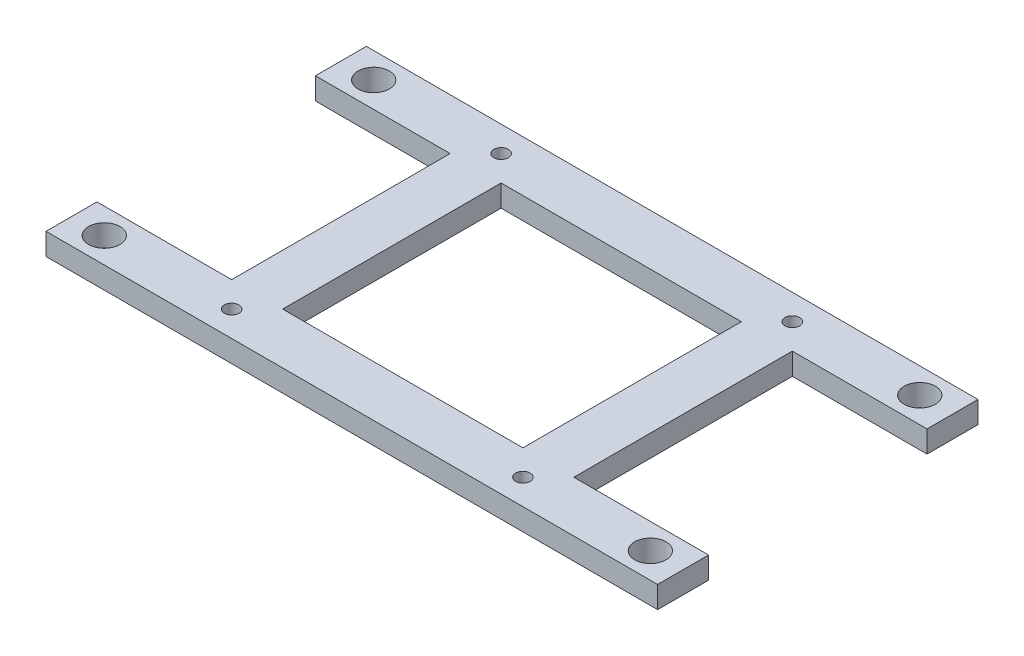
ISO-10303-21;
HEADER;
FILE_DESCRIPTION(('STEP AP214'),'2;1');
FILE_NAME('part.step','',(''),(''),'','','');
FILE_SCHEMA(('AUTOMOTIVE_DESIGN { 1 0 10303 214 1 1 1 1 }'));
ENDSEC;
DATA;
#1=APPLICATION_CONTEXT('core data for automotive mechanical design processes');
#2=APPLICATION_PROTOCOL_DEFINITION('international standard','automotive_design',2000,#1);
#3=PRODUCT_CONTEXT('',#1,'mechanical');
#4=PRODUCT('Part','Part','',(#3));
#5=PRODUCT_RELATED_PRODUCT_CATEGORY('part','',(#4));
#6=PRODUCT_DEFINITION_FORMATION('','',#4);
#7=PRODUCT_DEFINITION_CONTEXT('part definition',#1,'design');
#8=PRODUCT_DEFINITION('design','',#6,#7);
#9=PRODUCT_DEFINITION_SHAPE('','',#8);
#10=(LENGTH_UNIT() NAMED_UNIT(*) SI_UNIT(.MILLI.,.METRE.));
#11=(NAMED_UNIT(*) PLANE_ANGLE_UNIT() SI_UNIT($,.RADIAN.));
#12=(NAMED_UNIT(*) SI_UNIT($,.STERADIAN.) SOLID_ANGLE_UNIT());
#13=UNCERTAINTY_MEASURE_WITH_UNIT(LENGTH_MEASURE(1.E-05),#10,'distance_accuracy_value','');
#14=(GEOMETRIC_REPRESENTATION_CONTEXT(3) GLOBAL_UNCERTAINTY_ASSIGNED_CONTEXT((#13)) GLOBAL_UNIT_ASSIGNED_CONTEXT((#10,
#11,#12)) REPRESENTATION_CONTEXT('',''));
#15=CARTESIAN_POINT('',(0.,0.,0.));
#16=DIRECTION('',(0.,0.,1.));
#17=DIRECTION('',(1.,0.,0.));
#18=AXIS2_PLACEMENT_3D('',#15,#16,#17);
#19=CARTESIAN_POINT('',(0.,1.5,0.));
#20=DIRECTION('',(0.,1.,0.));
#21=DIRECTION('',(0.,0.,1.));
#22=AXIS2_PLACEMENT_3D('',#19,#20,#21);
#23=PLANE('',#22);
#24=CARTESIAN_POINT('',(37.5,1.5,18.5));
#25=DIRECTION('',(0.,1.,0.));
#26=DIRECTION('',(0.,0.,1.));
#27=AXIS2_PLACEMENT_3D('',#24,#25,#26);
#28=CIRCLE('',#27,2.15);
#29=CARTESIAN_POINT('',(37.5,1.5,20.65));
#30=VERTEX_POINT('',#29);
#31=EDGE_CURVE('E650',#30,#30,#28,.T.);
#32=ORIENTED_EDGE('',*,*,#31,.F.);
#33=EDGE_LOOP('',(#32));
#34=FACE_BOUND('',#33,.T.);
#35=CARTESIAN_POINT('',(-37.5,1.5,-18.5));
#36=DIRECTION('',(0.,1.,0.));
#37=DIRECTION('',(0.,0.,1.));
#38=AXIS2_PLACEMENT_3D('',#35,#36,#37);
#39=CIRCLE('',#38,2.15);
#40=CARTESIAN_POINT('',(-37.5,1.5,-16.35));
#41=VERTEX_POINT('',#40);
#42=EDGE_CURVE('E182',#41,#41,#39,.T.);
#43=ORIENTED_EDGE('',*,*,#42,.F.);
#44=EDGE_LOOP('',(#43));
#45=FACE_BOUND('',#44,.T.);
#46=CARTESIAN_POINT('',(20.,1.5,18.5));
#47=DIRECTION('',(0.,1.,0.));
#48=DIRECTION('',(0.,0.,1.));
#49=AXIS2_PLACEMENT_3D('',#46,#47,#48);
#50=CIRCLE('',#49,1.);
#51=CARTESIAN_POINT('',(20.,1.5,19.5));
#52=VERTEX_POINT('',#51);
#53=EDGE_CURVE('E198',#52,#52,#50,.T.);
#54=ORIENTED_EDGE('',*,*,#53,.F.);
#55=EDGE_LOOP('',(#54));
#56=FACE_BOUND('',#55,.T.);
#57=CARTESIAN_POINT('',(-20.,1.5,-18.5));
#58=DIRECTION('',(0.,1.,0.));
#59=DIRECTION('',(0.,0.,1.));
#60=AXIS2_PLACEMENT_3D('',#57,#58,#59);
#61=CIRCLE('',#60,1.);
#62=CARTESIAN_POINT('',(-20.,1.5,-17.5));
#63=VERTEX_POINT('',#62);
#64=EDGE_CURVE('E210',#63,#63,#61,.T.);
#65=ORIENTED_EDGE('',*,*,#64,.F.);
#66=EDGE_LOOP('',(#65));
#67=FACE_BOUND('',#66,.T.);
#68=DIRECTION('',(1.,0.,0.));
#69=VECTOR('',#68,1.);
#70=CARTESIAN_POINT('',(42.,1.5,-15.));
#71=LINE('',#70,#69);
#72=CARTESIAN_POINT('',(23.5,1.5,-15.));
#73=VERTEX_POINT('',#72);
#74=CARTESIAN_POINT('',(42.,1.5,-15.));
#75=VERTEX_POINT('',#74);
#76=EDGE_CURVE('E216',#73,#75,#71,.T.);
#77=ORIENTED_EDGE('',*,*,#76,.T.);
#78=DIRECTION('',(0.,0.,-1.));
#79=VECTOR('',#78,1.);
#80=CARTESIAN_POINT('',(42.,1.5,-22.));
#81=LINE('',#80,#79);
#82=CARTESIAN_POINT('',(42.,1.5,-22.));
#83=VERTEX_POINT('',#82);
#84=EDGE_CURVE('E219',#75,#83,#81,.T.);
#85=ORIENTED_EDGE('',*,*,#84,.T.);
#86=DIRECTION('',(-1.,0.,0.));
#87=VECTOR('',#86,1.);
#88=CARTESIAN_POINT('',(-42.,1.5,-22.));
#89=LINE('',#88,#87);
#90=CARTESIAN_POINT('',(-42.,1.5,-22.));
#91=VERTEX_POINT('',#90);
#92=EDGE_CURVE('E222',#83,#91,#89,.T.);
#93=ORIENTED_EDGE('',*,*,#92,.T.);
#94=DIRECTION('',(0.,0.,1.));
#95=VECTOR('',#94,1.);
#96=CARTESIAN_POINT('',(-42.,1.5,-15.));
#97=LINE('',#96,#95);
#98=CARTESIAN_POINT('',(-42.,1.5,-15.));
#99=VERTEX_POINT('',#98);
#100=EDGE_CURVE('E224',#91,#99,#97,.T.);
#101=ORIENTED_EDGE('',*,*,#100,.T.);
#102=DIRECTION('',(1.,0.,0.));
#103=VECTOR('',#102,1.);
#104=CARTESIAN_POINT('',(-23.5,1.5,-15.));
#105=LINE('',#104,#103);
#106=CARTESIAN_POINT('',(-23.5,1.5,-15.));
#107=VERTEX_POINT('',#106);
#108=EDGE_CURVE('E226',#99,#107,#105,.T.);
#109=ORIENTED_EDGE('',*,*,#108,.T.);
#110=DIRECTION('',(0.,0.,1.));
#111=VECTOR('',#110,1.);
#112=CARTESIAN_POINT('',(-23.5,1.5,15.));
#113=LINE('',#112,#111);
#114=CARTESIAN_POINT('',(-23.5,1.5,15.));
#115=VERTEX_POINT('',#114);
#116=EDGE_CURVE('E228',#107,#115,#113,.T.);
#117=ORIENTED_EDGE('',*,*,#116,.T.);
#118=DIRECTION('',(-1.,0.,0.));
#119=VECTOR('',#118,1.);
#120=CARTESIAN_POINT('',(-42.,1.5,15.));
#121=LINE('',#120,#119);
#122=CARTESIAN_POINT('',(-42.,1.5,15.));
#123=VERTEX_POINT('',#122);
#124=EDGE_CURVE('E230',#115,#123,#121,.T.);
#125=ORIENTED_EDGE('',*,*,#124,.T.);
#126=DIRECTION('',(0.,0.,1.));
#127=VECTOR('',#126,1.);
#128=CARTESIAN_POINT('',(-42.,1.5,22.));
#129=LINE('',#128,#127);
#130=CARTESIAN_POINT('',(-42.,1.5,22.));
#131=VERTEX_POINT('',#130);
#132=EDGE_CURVE('E232',#123,#131,#129,.T.);
#133=ORIENTED_EDGE('',*,*,#132,.T.);
#134=DIRECTION('',(1.,0.,0.));
#135=VECTOR('',#134,1.);
#136=CARTESIAN_POINT('',(42.,1.5,22.));
#137=LINE('',#136,#135);
#138=CARTESIAN_POINT('',(42.,1.5,22.));
#139=VERTEX_POINT('',#138);
#140=EDGE_CURVE('E234',#131,#139,#137,.T.);
#141=ORIENTED_EDGE('',*,*,#140,.T.);
#142=DIRECTION('',(0.,0.,-1.));
#143=VECTOR('',#142,1.);
#144=CARTESIAN_POINT('',(42.,1.5,15.));
#145=LINE('',#144,#143);
#146=CARTESIAN_POINT('',(42.,1.5,15.));
#147=VERTEX_POINT('',#146);
#148=EDGE_CURVE('E236',#139,#147,#145,.T.);
#149=ORIENTED_EDGE('',*,*,#148,.T.);
#150=DIRECTION('',(-1.,0.,0.));
#151=VECTOR('',#150,1.);
#152=CARTESIAN_POINT('',(23.5,1.5,15.));
#153=LINE('',#152,#151);
#154=CARTESIAN_POINT('',(23.5,1.5,15.));
#155=VERTEX_POINT('',#154);
#156=EDGE_CURVE('E238',#147,#155,#153,.T.);
#157=ORIENTED_EDGE('',*,*,#156,.T.);
#158=DIRECTION('',(0.,0.,-1.));
#159=VECTOR('',#158,1.);
#160=CARTESIAN_POINT('',(23.5,1.5,-15.));
#161=LINE('',#160,#159);
#162=EDGE_CURVE('E240',#155,#73,#161,.T.);
#163=ORIENTED_EDGE('',*,*,#162,.T.);
#164=EDGE_LOOP('',(#77,#85,#93,#101,#109,#117,#125,#133,#141,#149,#157,#163));
#165=FACE_BOUND('',#164,.T.);
#166=CARTESIAN_POINT('',(20.,1.5,-18.5));
#167=DIRECTION('',(0.,1.,0.));
#168=DIRECTION('',(0.,0.,1.));
#169=AXIS2_PLACEMENT_3D('',#166,#167,#168);
#170=CIRCLE('',#169,1.);
#171=CARTESIAN_POINT('',(20.,1.5,-17.5));
#172=VERTEX_POINT('',#171);
#173=EDGE_CURVE('E204',#172,#172,#170,.T.);
#174=ORIENTED_EDGE('',*,*,#173,.F.);
#175=EDGE_LOOP('',(#174));
#176=FACE_BOUND('',#175,.T.);
#177=CARTESIAN_POINT('',(-20.,1.5,18.5));
#178=DIRECTION('',(0.,1.,0.));
#179=DIRECTION('',(0.,0.,1.));
#180=AXIS2_PLACEMENT_3D('',#177,#178,#179);
#181=CIRCLE('',#180,1.);
#182=CARTESIAN_POINT('',(-20.,1.5,19.5));
#183=VERTEX_POINT('',#182);
#184=EDGE_CURVE('E192',#183,#183,#181,.T.);
#185=ORIENTED_EDGE('',*,*,#184,.F.);
#186=EDGE_LOOP('',(#185));
#187=FACE_BOUND('',#186,.T.);
#188=DIRECTION('',(1.,0.,0.));
#189=VECTOR('',#188,1.);
#190=CARTESIAN_POINT('',(16.5,1.5,15.));
#191=LINE('',#190,#189);
#192=CARTESIAN_POINT('',(-16.5,1.5,15.));
#193=VERTEX_POINT('',#192);
#194=CARTESIAN_POINT('',(16.5,1.5,15.));
#195=VERTEX_POINT('',#194);
#196=EDGE_CURVE('E161',#193,#195,#191,.T.);
#197=ORIENTED_EDGE('',*,*,#196,.F.);
#198=DIRECTION('',(0.,0.,1.));
#199=VECTOR('',#198,1.);
#200=CARTESIAN_POINT('',(-16.5,1.5,15.));
#201=LINE('',#200,#199);
#202=CARTESIAN_POINT('',(-16.5,1.5,-15.));
#203=VERTEX_POINT('',#202);
#204=EDGE_CURVE('E153',#203,#193,#201,.T.);
#205=ORIENTED_EDGE('',*,*,#204,.F.);
#206=DIRECTION('',(-1.,0.,0.));
#207=VECTOR('',#206,1.);
#208=CARTESIAN_POINT('',(16.5,1.5,-15.));
#209=LINE('',#208,#207);
#210=CARTESIAN_POINT('',(16.5,1.5,-15.));
#211=VERTEX_POINT('',#210);
#212=EDGE_CURVE('E176',#211,#203,#209,.T.);
#213=ORIENTED_EDGE('',*,*,#212,.F.);
#214=DIRECTION('',(0.,0.,-1.));
#215=VECTOR('',#214,1.);
#216=CARTESIAN_POINT('',(16.5,1.5,15.));
#217=LINE('',#216,#215);
#218=EDGE_CURVE('E174',#195,#211,#217,.T.);
#219=ORIENTED_EDGE('',*,*,#218,.F.);
#220=EDGE_LOOP('',(#197,#205,#213,#219));
#221=FACE_BOUND('',#220,.T.);
#222=CARTESIAN_POINT('',(-37.5,1.5,18.5));
#223=DIRECTION('',(0.,1.,0.));
#224=DIRECTION('',(0.,0.,1.));
#225=AXIS2_PLACEMENT_3D('',#222,#223,#224);
#226=CIRCLE('',#225,2.15);
#227=CARTESIAN_POINT('',(-37.5,1.5,20.65));
#228=VERTEX_POINT('',#227);
#229=EDGE_CURVE('E656',#228,#228,#226,.T.);
#230=ORIENTED_EDGE('',*,*,#229,.F.);
#231=EDGE_LOOP('',(#230));
#232=FACE_BOUND('',#231,.T.);
#233=CARTESIAN_POINT('',(37.5,1.5,-18.5));
#234=DIRECTION('',(0.,1.,0.));
#235=DIRECTION('',(0.,0.,1.));
#236=AXIS2_PLACEMENT_3D('',#233,#234,#235);
#237=CIRCLE('',#236,2.15);
#238=CARTESIAN_POINT('',(37.5,1.5,-16.35));
#239=VERTEX_POINT('',#238);
#240=EDGE_CURVE('E641',#239,#239,#237,.T.);
#241=ORIENTED_EDGE('',*,*,#240,.F.);
#242=EDGE_LOOP('',(#241));
#243=FACE_BOUND('',#242,.T.);
#244=ADVANCED_FACE('F40',(#34,#45,#56,#67,#165,#176,#187,#221,#232,#243),#23,.T.);
#245=CARTESIAN_POINT('',(0.,-1.5,0.));
#246=DIRECTION('',(0.,1.,0.));
#247=DIRECTION('',(0.,0.,1.));
#248=AXIS2_PLACEMENT_3D('',#245,#246,#247);
#249=PLANE('',#248);
#250=CARTESIAN_POINT('',(-20.,-1.5,18.5));
#251=DIRECTION('',(0.,1.,0.));
#252=DIRECTION('',(0.,0.,1.));
#253=AXIS2_PLACEMENT_3D('',#250,#251,#252);
#254=CIRCLE('',#253,1.);
#255=CARTESIAN_POINT('',(-20.,-1.5,19.5));
#256=VERTEX_POINT('',#255);
#257=EDGE_CURVE('E169',#256,#256,#254,.T.);
#258=ORIENTED_EDGE('',*,*,#257,.T.);
#259=EDGE_LOOP('',(#258));
#260=FACE_BOUND('',#259,.T.);
#261=CARTESIAN_POINT('',(20.,-1.5,18.5));
#262=DIRECTION('',(0.,1.,0.));
#263=DIRECTION('',(0.,0.,1.));
#264=AXIS2_PLACEMENT_3D('',#261,#262,#263);
#265=CIRCLE('',#264,1.);
#266=CARTESIAN_POINT('',(20.,-1.5,19.5));
#267=VERTEX_POINT('',#266);
#268=EDGE_CURVE('E195',#267,#267,#265,.T.);
#269=ORIENTED_EDGE('',*,*,#268,.T.);
#270=EDGE_LOOP('',(#269));
#271=FACE_BOUND('',#270,.T.);
#272=CARTESIAN_POINT('',(20.,-1.5,-18.5));
#273=DIRECTION('',(0.,1.,0.));
#274=DIRECTION('',(0.,0.,1.));
#275=AXIS2_PLACEMENT_3D('',#272,#273,#274);
#276=CIRCLE('',#275,1.);
#277=CARTESIAN_POINT('',(20.,-1.5,-17.5));
#278=VERTEX_POINT('',#277);
#279=EDGE_CURVE('E201',#278,#278,#276,.T.);
#280=ORIENTED_EDGE('',*,*,#279,.T.);
#281=EDGE_LOOP('',(#280));
#282=FACE_BOUND('',#281,.T.);
#283=CARTESIAN_POINT('',(-20.,-1.5,-18.5));
#284=DIRECTION('',(0.,1.,0.));
#285=DIRECTION('',(0.,0.,1.));
#286=AXIS2_PLACEMENT_3D('',#283,#284,#285);
#287=CIRCLE('',#286,1.);
#288=CARTESIAN_POINT('',(-20.,-1.5,-17.5));
#289=VERTEX_POINT('',#288);
#290=EDGE_CURVE('E207',#289,#289,#287,.T.);
#291=ORIENTED_EDGE('',*,*,#290,.T.);
#292=EDGE_LOOP('',(#291));
#293=FACE_BOUND('',#292,.T.);
#294=DIRECTION('',(1.,0.,0.));
#295=VECTOR('',#294,1.);
#296=CARTESIAN_POINT('',(42.,-1.5,-15.));
#297=LINE('',#296,#295);
#298=CARTESIAN_POINT('',(23.5,-1.5,-15.));
#299=VERTEX_POINT('',#298);
#300=CARTESIAN_POINT('',(42.,-1.5,-15.));
#301=VERTEX_POINT('',#300);
#302=EDGE_CURVE('E213',#299,#301,#297,.T.);
#303=ORIENTED_EDGE('',*,*,#302,.F.);
#304=DIRECTION('',(0.,0.,-1.));
#305=VECTOR('',#304,1.);
#306=CARTESIAN_POINT('',(23.5,-1.5,-15.));
#307=LINE('',#306,#305);
#308=CARTESIAN_POINT('',(23.5,-1.5,15.));
#309=VERTEX_POINT('',#308);
#310=EDGE_CURVE('E220',#309,#299,#307,.T.);
#311=ORIENTED_EDGE('',*,*,#310,.F.);
#312=DIRECTION('',(-1.,0.,0.));
#313=VECTOR('',#312,1.);
#314=CARTESIAN_POINT('',(23.5,-1.5,15.));
#315=LINE('',#314,#313);
#316=CARTESIAN_POINT('',(42.,-1.5,15.));
#317=VERTEX_POINT('',#316);
#318=EDGE_CURVE('E263',#317,#309,#315,.T.);
#319=ORIENTED_EDGE('',*,*,#318,.F.);
#320=DIRECTION('',(0.,0.,-1.));
#321=VECTOR('',#320,1.);
#322=CARTESIAN_POINT('',(42.,-1.5,15.));
#323=LINE('',#322,#321);
#324=CARTESIAN_POINT('',(42.,-1.5,22.));
#325=VERTEX_POINT('',#324);
#326=EDGE_CURVE('E261',#325,#317,#323,.T.);
#327=ORIENTED_EDGE('',*,*,#326,.F.);
#328=DIRECTION('',(1.,0.,0.));
#329=VECTOR('',#328,1.);
#330=CARTESIAN_POINT('',(42.,-1.5,22.));
#331=LINE('',#330,#329);
#332=CARTESIAN_POINT('',(-42.,-1.5,22.));
#333=VERTEX_POINT('',#332);
#334=EDGE_CURVE('E259',#333,#325,#331,.T.);
#335=ORIENTED_EDGE('',*,*,#334,.F.);
#336=DIRECTION('',(0.,0.,1.));
#337=VECTOR('',#336,1.);
#338=CARTESIAN_POINT('',(-42.,-1.5,22.));
#339=LINE('',#338,#337);
#340=CARTESIAN_POINT('',(-42.,-1.5,15.));
#341=VERTEX_POINT('',#340);
#342=EDGE_CURVE('E257',#341,#333,#339,.T.);
#343=ORIENTED_EDGE('',*,*,#342,.F.);
#344=DIRECTION('',(-1.,0.,0.));
#345=VECTOR('',#344,1.);
#346=CARTESIAN_POINT('',(-42.,-1.5,15.));
#347=LINE('',#346,#345);
#348=CARTESIAN_POINT('',(-23.5,-1.5,15.));
#349=VERTEX_POINT('',#348);
#350=EDGE_CURVE('E255',#349,#341,#347,.T.);
#351=ORIENTED_EDGE('',*,*,#350,.F.);
#352=DIRECTION('',(0.,0.,1.));
#353=VECTOR('',#352,1.);
#354=CARTESIAN_POINT('',(-23.5,-1.5,15.));
#355=LINE('',#354,#353);
#356=CARTESIAN_POINT('',(-23.5,-1.5,-15.));
#357=VERTEX_POINT('',#356);
#358=EDGE_CURVE('E253',#357,#349,#355,.T.);
#359=ORIENTED_EDGE('',*,*,#358,.F.);
#360=DIRECTION('',(1.,0.,0.));
#361=VECTOR('',#360,1.);
#362=CARTESIAN_POINT('',(-23.5,-1.5,-15.));
#363=LINE('',#362,#361);
#364=CARTESIAN_POINT('',(-42.,-1.5,-15.));
#365=VERTEX_POINT('',#364);
#366=EDGE_CURVE('E251',#365,#357,#363,.T.);
#367=ORIENTED_EDGE('',*,*,#366,.F.);
#368=DIRECTION('',(0.,0.,1.));
#369=VECTOR('',#368,1.);
#370=CARTESIAN_POINT('',(-42.,-1.5,-15.));
#371=LINE('',#370,#369);
#372=CARTESIAN_POINT('',(-42.,-1.5,-22.));
#373=VERTEX_POINT('',#372);
#374=EDGE_CURVE('E249',#373,#365,#371,.T.);
#375=ORIENTED_EDGE('',*,*,#374,.F.);
#376=DIRECTION('',(-1.,0.,0.));
#377=VECTOR('',#376,1.);
#378=CARTESIAN_POINT('',(-42.,-1.5,-22.));
#379=LINE('',#378,#377);
#380=CARTESIAN_POINT('',(42.,-1.5,-22.));
#381=VERTEX_POINT('',#380);
#382=EDGE_CURVE('E247',#381,#373,#379,.T.);
#383=ORIENTED_EDGE('',*,*,#382,.F.);
#384=DIRECTION('',(0.,0.,-1.));
#385=VECTOR('',#384,1.);
#386=CARTESIAN_POINT('',(42.,-1.5,-22.));
#387=LINE('',#386,#385);
#388=EDGE_CURVE('E245',#301,#381,#387,.T.);
#389=ORIENTED_EDGE('',*,*,#388,.F.);
#390=EDGE_LOOP('',(#303,#311,#319,#327,#335,#343,#351,#359,#367,#375,#383,#389));
#391=FACE_BOUND('',#390,.T.);
#392=DIRECTION('',(0.,0.,1.));
#393=VECTOR('',#392,1.);
#394=CARTESIAN_POINT('',(-16.5,-1.5,15.));
#395=LINE('',#394,#393);
#396=CARTESIAN_POINT('',(-16.5,-1.5,-15.));
#397=VERTEX_POINT('',#396);
#398=CARTESIAN_POINT('',(-16.5,-1.5,15.));
#399=VERTEX_POINT('',#398);
#400=EDGE_CURVE('E63',#397,#399,#395,.T.);
#401=ORIENTED_EDGE('',*,*,#400,.T.);
#402=DIRECTION('',(1.,0.,0.));
#403=VECTOR('',#402,1.);
#404=CARTESIAN_POINT('',(16.5,-1.5,15.));
#405=LINE('',#404,#403);
#406=CARTESIAN_POINT('',(16.5,-1.5,15.));
#407=VERTEX_POINT('',#406);
#408=EDGE_CURVE('E168',#399,#407,#405,.T.);
#409=ORIENTED_EDGE('',*,*,#408,.T.);
#410=DIRECTION('',(0.,0.,-1.));
#411=VECTOR('',#410,1.);
#412=CARTESIAN_POINT('',(16.5,-1.5,15.));
#413=LINE('',#412,#411);
#414=CARTESIAN_POINT('',(16.5,-1.5,-15.));
#415=VERTEX_POINT('',#414);
#416=EDGE_CURVE('E184',#407,#415,#413,.T.);
#417=ORIENTED_EDGE('',*,*,#416,.T.);
#418=DIRECTION('',(-1.,0.,0.));
#419=VECTOR('',#418,1.);
#420=CARTESIAN_POINT('',(16.5,-1.5,-15.));
#421=LINE('',#420,#419);
#422=EDGE_CURVE('E162',#415,#397,#421,.T.);
#423=ORIENTED_EDGE('',*,*,#422,.T.);
#424=EDGE_LOOP('',(#401,#409,#417,#423));
#425=FACE_BOUND('',#424,.T.);
#426=CARTESIAN_POINT('',(-37.5,-1.5,-18.5));
#427=DIRECTION('',(0.,1.,0.));
#428=DIRECTION('',(0.,0.,1.));
#429=AXIS2_PLACEMENT_3D('',#426,#427,#428);
#430=CIRCLE('',#429,2.15);
#431=CARTESIAN_POINT('',(-37.5,-1.5,-16.35));
#432=VERTEX_POINT('',#431);
#433=EDGE_CURVE('E659',#432,#432,#430,.T.);
#434=ORIENTED_EDGE('',*,*,#433,.T.);
#435=EDGE_LOOP('',(#434));
#436=FACE_BOUND('',#435,.T.);
#437=CARTESIAN_POINT('',(-37.5,-1.5,18.5));
#438=DIRECTION('',(0.,1.,0.));
#439=DIRECTION('',(0.,0.,1.));
#440=AXIS2_PLACEMENT_3D('',#437,#438,#439);
#441=CIRCLE('',#440,2.15);
#442=CARTESIAN_POINT('',(-37.5,-1.5,20.65));
#443=VERTEX_POINT('',#442);
#444=EDGE_CURVE('E653',#443,#443,#441,.T.);
#445=ORIENTED_EDGE('',*,*,#444,.T.);
#446=EDGE_LOOP('',(#445));
#447=FACE_BOUND('',#446,.T.);
#448=CARTESIAN_POINT('',(37.5,-1.5,18.5));
#449=DIRECTION('',(0.,1.,0.));
#450=DIRECTION('',(0.,0.,1.));
#451=AXIS2_PLACEMENT_3D('',#448,#449,#450);
#452=CIRCLE('',#451,2.15);
#453=CARTESIAN_POINT('',(37.5,-1.5,20.65));
#454=VERTEX_POINT('',#453);
#455=EDGE_CURVE('E647',#454,#454,#452,.T.);
#456=ORIENTED_EDGE('',*,*,#455,.T.);
#457=EDGE_LOOP('',(#456));
#458=FACE_BOUND('',#457,.T.);
#459=CARTESIAN_POINT('',(37.5,-1.5,-18.5));
#460=DIRECTION('',(0.,1.,0.));
#461=DIRECTION('',(0.,0.,1.));
#462=AXIS2_PLACEMENT_3D('',#459,#460,#461);
#463=CIRCLE('',#462,2.15);
#464=CARTESIAN_POINT('',(37.5,-1.5,-16.35));
#465=VERTEX_POINT('',#464);
#466=EDGE_CURVE('E644',#465,#465,#463,.T.);
#467=ORIENTED_EDGE('',*,*,#466,.T.);
#468=EDGE_LOOP('',(#467));
#469=FACE_BOUND('',#468,.T.);
#470=ADVANCED_FACE('F305',(#260,#271,#282,#293,#391,#425,#436,#447,#458,#469),#249,.F.);
#471=CARTESIAN_POINT('',(42.,1.5,-15.));
#472=DIRECTION('',(0.,0.,-1.));
#473=DIRECTION('',(-1.,0.,0.));
#474=AXIS2_PLACEMENT_3D('',#471,#472,#473);
#475=PLANE('',#474);
#476=ORIENTED_EDGE('',*,*,#302,.T.);
#477=DIRECTION('',(0.,-1.,0.));
#478=VECTOR('',#477,1.);
#479=CARTESIAN_POINT('',(42.,1.5,-15.));
#480=LINE('',#479,#478);
#481=EDGE_CURVE('E11',#75,#301,#480,.T.);
#482=ORIENTED_EDGE('',*,*,#481,.F.);
#483=ORIENTED_EDGE('',*,*,#76,.F.);
#484=DIRECTION('',(0.,-1.,0.));
#485=VECTOR('',#484,1.);
#486=CARTESIAN_POINT('',(23.5,1.5,-15.));
#487=LINE('',#486,#485);
#488=EDGE_CURVE('E242',#73,#299,#487,.T.);
#489=ORIENTED_EDGE('',*,*,#488,.T.);
#490=EDGE_LOOP('',(#476,#482,#483,#489));
#491=FACE_BOUND('',#490,.T.);
#492=ADVANCED_FACE('F42',(#491),#475,.F.);
#493=CARTESIAN_POINT('',(42.,1.5,-22.));
#494=DIRECTION('',(-1.,0.,0.));
#495=DIRECTION('',(0.,0.,1.));
#496=AXIS2_PLACEMENT_3D('',#493,#494,#495);
#497=PLANE('',#496);
#498=ORIENTED_EDGE('',*,*,#388,.T.);
#499=DIRECTION('',(0.,-1.,0.));
#500=VECTOR('',#499,1.);
#501=CARTESIAN_POINT('',(42.,1.5,-22.));
#502=LINE('',#501,#500);
#503=EDGE_CURVE('E48',#83,#381,#502,.T.);
#504=ORIENTED_EDGE('',*,*,#503,.F.);
#505=ORIENTED_EDGE('',*,*,#84,.F.);
#506=ORIENTED_EDGE('',*,*,#481,.T.);
#507=EDGE_LOOP('',(#498,#504,#505,#506));
#508=FACE_BOUND('',#507,.T.);
#509=ADVANCED_FACE('F323',(#508),#497,.F.);
#510=CARTESIAN_POINT('',(-42.,1.5,-22.));
#511=DIRECTION('',(0.,0.,1.));
#512=DIRECTION('',(1.,0.,0.));
#513=AXIS2_PLACEMENT_3D('',#510,#511,#512);
#514=PLANE('',#513);
#515=ORIENTED_EDGE('',*,*,#382,.T.);
#516=DIRECTION('',(0.,-1.,0.));
#517=VECTOR('',#516,1.);
#518=CARTESIAN_POINT('',(-42.,1.5,-22.));
#519=LINE('',#518,#517);
#520=EDGE_CURVE('E292',#91,#373,#519,.T.);
#521=ORIENTED_EDGE('',*,*,#520,.F.);
#522=ORIENTED_EDGE('',*,*,#92,.F.);
#523=ORIENTED_EDGE('',*,*,#503,.T.);
#524=EDGE_LOOP('',(#515,#521,#522,#523));
#525=FACE_BOUND('',#524,.T.);
#526=ADVANCED_FACE('F299',(#525),#514,.F.);
#527=CARTESIAN_POINT('',(-42.,1.5,-15.));
#528=DIRECTION('',(1.,0.,0.));
#529=DIRECTION('',(0.,0.,-1.));
#530=AXIS2_PLACEMENT_3D('',#527,#528,#529);
#531=PLANE('',#530);
#532=ORIENTED_EDGE('',*,*,#374,.T.);
#533=DIRECTION('',(0.,-1.,0.));
#534=VECTOR('',#533,1.);
#535=CARTESIAN_POINT('',(-42.,1.5,-15.));
#536=LINE('',#535,#534);
#537=EDGE_CURVE('E289',#99,#365,#536,.T.);
#538=ORIENTED_EDGE('',*,*,#537,.F.);
#539=ORIENTED_EDGE('',*,*,#100,.F.);
#540=ORIENTED_EDGE('',*,*,#520,.T.);
#541=EDGE_LOOP('',(#532,#538,#539,#540));
#542=FACE_BOUND('',#541,.T.);
#543=ADVANCED_FACE('F311',(#542),#531,.F.);
#544=CARTESIAN_POINT('',(-23.5,1.5,-15.));
#545=DIRECTION('',(0.,0.,-1.));
#546=DIRECTION('',(-1.,0.,0.));
#547=AXIS2_PLACEMENT_3D('',#544,#545,#546);
#548=PLANE('',#547);
#549=ORIENTED_EDGE('',*,*,#366,.T.);
#550=DIRECTION('',(0.,-1.,0.));
#551=VECTOR('',#550,1.);
#552=CARTESIAN_POINT('',(-23.5,1.5,-15.));
#553=LINE('',#552,#551);
#554=EDGE_CURVE('E286',#107,#357,#553,.T.);
#555=ORIENTED_EDGE('',*,*,#554,.F.);
#556=ORIENTED_EDGE('',*,*,#108,.F.);
#557=ORIENTED_EDGE('',*,*,#537,.T.);
#558=EDGE_LOOP('',(#549,#555,#556,#557));
#559=FACE_BOUND('',#558,.T.);
#560=ADVANCED_FACE('F315',(#559),#548,.F.);
#561=CARTESIAN_POINT('',(-23.5,1.5,15.));
#562=DIRECTION('',(1.,0.,0.));
#563=DIRECTION('',(0.,0.,-1.));
#564=AXIS2_PLACEMENT_3D('',#561,#562,#563);
#565=PLANE('',#564);
#566=ORIENTED_EDGE('',*,*,#358,.T.);
#567=DIRECTION('',(0.,-1.,0.));
#568=VECTOR('',#567,1.);
#569=CARTESIAN_POINT('',(-23.5,1.5,15.));
#570=LINE('',#569,#568);
#571=EDGE_CURVE('E283',#115,#349,#570,.T.);
#572=ORIENTED_EDGE('',*,*,#571,.F.);
#573=ORIENTED_EDGE('',*,*,#116,.F.);
#574=ORIENTED_EDGE('',*,*,#554,.T.);
#575=EDGE_LOOP('',(#566,#572,#573,#574));
#576=FACE_BOUND('',#575,.T.);
#577=ADVANCED_FACE('F356',(#576),#565,.F.);
#578=CARTESIAN_POINT('',(-42.,1.5,15.));
#579=DIRECTION('',(0.,0.,1.));
#580=DIRECTION('',(1.,0.,0.));
#581=AXIS2_PLACEMENT_3D('',#578,#579,#580);
#582=PLANE('',#581);
#583=ORIENTED_EDGE('',*,*,#350,.T.);
#584=DIRECTION('',(0.,-1.,0.));
#585=VECTOR('',#584,1.);
#586=CARTESIAN_POINT('',(-42.,1.5,15.));
#587=LINE('',#586,#585);
#588=EDGE_CURVE('E280',#123,#341,#587,.T.);
#589=ORIENTED_EDGE('',*,*,#588,.F.);
#590=ORIENTED_EDGE('',*,*,#124,.F.);
#591=ORIENTED_EDGE('',*,*,#571,.T.);
#592=EDGE_LOOP('',(#583,#589,#590,#591));
#593=FACE_BOUND('',#592,.T.);
#594=ADVANCED_FACE('F354',(#593),#582,.F.);
#595=CARTESIAN_POINT('',(-42.,1.5,22.));
#596=DIRECTION('',(1.,0.,0.));
#597=DIRECTION('',(0.,0.,-1.));
#598=AXIS2_PLACEMENT_3D('',#595,#596,#597);
#599=PLANE('',#598);
#600=ORIENTED_EDGE('',*,*,#342,.T.);
#601=DIRECTION('',(0.,-1.,0.));
#602=VECTOR('',#601,1.);
#603=CARTESIAN_POINT('',(-42.,1.5,22.));
#604=LINE('',#603,#602);
#605=EDGE_CURVE('E277',#131,#333,#604,.T.);
#606=ORIENTED_EDGE('',*,*,#605,.F.);
#607=ORIENTED_EDGE('',*,*,#132,.F.);
#608=ORIENTED_EDGE('',*,*,#588,.T.);
#609=EDGE_LOOP('',(#600,#606,#607,#608));
#610=FACE_BOUND('',#609,.T.);
#611=ADVANCED_FACE('F350',(#610),#599,.F.);
#612=CARTESIAN_POINT('',(42.,1.5,22.));
#613=DIRECTION('',(0.,0.,-1.));
#614=DIRECTION('',(-1.,0.,0.));
#615=AXIS2_PLACEMENT_3D('',#612,#613,#614);
#616=PLANE('',#615);
#617=ORIENTED_EDGE('',*,*,#334,.T.);
#618=DIRECTION('',(0.,-1.,0.));
#619=VECTOR('',#618,1.);
#620=CARTESIAN_POINT('',(42.,1.5,22.));
#621=LINE('',#620,#619);
#622=EDGE_CURVE('E274',#139,#325,#621,.T.);
#623=ORIENTED_EDGE('',*,*,#622,.F.);
#624=ORIENTED_EDGE('',*,*,#140,.F.);
#625=ORIENTED_EDGE('',*,*,#605,.T.);
#626=EDGE_LOOP('',(#617,#623,#624,#625));
#627=FACE_BOUND('',#626,.T.);
#628=ADVANCED_FACE('F345',(#627),#616,.F.);
#629=CARTESIAN_POINT('',(42.,1.5,15.));
#630=DIRECTION('',(-1.,0.,0.));
#631=DIRECTION('',(0.,0.,1.));
#632=AXIS2_PLACEMENT_3D('',#629,#630,#631);
#633=PLANE('',#632);
#634=ORIENTED_EDGE('',*,*,#326,.T.);
#635=DIRECTION('',(0.,-1.,0.));
#636=VECTOR('',#635,1.);
#637=CARTESIAN_POINT('',(42.,1.5,15.));
#638=LINE('',#637,#636);
#639=EDGE_CURVE('E271',#147,#317,#638,.T.);
#640=ORIENTED_EDGE('',*,*,#639,.F.);
#641=ORIENTED_EDGE('',*,*,#148,.F.);
#642=ORIENTED_EDGE('',*,*,#622,.T.);
#643=EDGE_LOOP('',(#634,#640,#641,#642));
#644=FACE_BOUND('',#643,.T.);
#645=ADVANCED_FACE('F339',(#644),#633,.F.);
#646=CARTESIAN_POINT('',(23.5,1.5,15.));
#647=DIRECTION('',(0.,0.,1.));
#648=DIRECTION('',(1.,0.,0.));
#649=AXIS2_PLACEMENT_3D('',#646,#647,#648);
#650=PLANE('',#649);
#651=ORIENTED_EDGE('',*,*,#318,.T.);
#652=DIRECTION('',(0.,-1.,0.));
#653=VECTOR('',#652,1.);
#654=CARTESIAN_POINT('',(23.5,1.5,15.));
#655=LINE('',#654,#653);
#656=EDGE_CURVE('E268',#155,#309,#655,.T.);
#657=ORIENTED_EDGE('',*,*,#656,.F.);
#658=ORIENTED_EDGE('',*,*,#156,.F.);
#659=ORIENTED_EDGE('',*,*,#639,.T.);
#660=EDGE_LOOP('',(#651,#657,#658,#659));
#661=FACE_BOUND('',#660,.T.);
#662=ADVANCED_FACE('F335',(#661),#650,.F.);
#663=CARTESIAN_POINT('',(23.5,1.5,-15.));
#664=DIRECTION('',(-1.,0.,0.));
#665=DIRECTION('',(0.,0.,1.));
#666=AXIS2_PLACEMENT_3D('',#663,#664,#665);
#667=PLANE('',#666);
#668=ORIENTED_EDGE('',*,*,#310,.T.);
#669=ORIENTED_EDGE('',*,*,#488,.F.);
#670=ORIENTED_EDGE('',*,*,#162,.F.);
#671=ORIENTED_EDGE('',*,*,#656,.T.);
#672=EDGE_LOOP('',(#668,#669,#670,#671));
#673=FACE_BOUND('',#672,.T.);
#674=ADVANCED_FACE('F330',(#673),#667,.F.);
#675=CARTESIAN_POINT('',(-20.,1.5,-18.5));
#676=DIRECTION('',(0.,-1.,0.));
#677=DIRECTION('',(0.,0.,-1.));
#678=AXIS2_PLACEMENT_3D('',#675,#676,#677);
#679=CYLINDRICAL_SURFACE('',#678,1.);
#680=ORIENTED_EDGE('',*,*,#64,.T.);
#681=EDGE_LOOP('',(#680));
#682=FACE_BOUND('',#681,.T.);
#683=ORIENTED_EDGE('',*,*,#290,.F.);
#684=EDGE_LOOP('',(#683));
#685=FACE_BOUND('',#684,.T.);
#686=ADVANCED_FACE('F376',(#682,#685),#679,.F.);
#687=CARTESIAN_POINT('',(20.,1.5,-18.5));
#688=DIRECTION('',(0.,-1.,0.));
#689=DIRECTION('',(0.,0.,-1.));
#690=AXIS2_PLACEMENT_3D('',#687,#688,#689);
#691=CYLINDRICAL_SURFACE('',#690,1.);
#692=ORIENTED_EDGE('',*,*,#173,.T.);
#693=EDGE_LOOP('',(#692));
#694=FACE_BOUND('',#693,.T.);
#695=ORIENTED_EDGE('',*,*,#279,.F.);
#696=EDGE_LOOP('',(#695));
#697=FACE_BOUND('',#696,.T.);
#698=ADVANCED_FACE('F414',(#694,#697),#691,.F.);
#699=CARTESIAN_POINT('',(20.,1.5,18.5));
#700=DIRECTION('',(0.,-1.,0.));
#701=DIRECTION('',(0.,0.,-1.));
#702=AXIS2_PLACEMENT_3D('',#699,#700,#701);
#703=CYLINDRICAL_SURFACE('',#702,1.);
#704=ORIENTED_EDGE('',*,*,#53,.T.);
#705=EDGE_LOOP('',(#704));
#706=FACE_BOUND('',#705,.T.);
#707=ORIENTED_EDGE('',*,*,#268,.F.);
#708=EDGE_LOOP('',(#707));
#709=FACE_BOUND('',#708,.T.);
#710=ADVANCED_FACE('F421',(#706,#709),#703,.F.);
#711=CARTESIAN_POINT('',(-20.,1.5,18.5));
#712=DIRECTION('',(0.,-1.,0.));
#713=DIRECTION('',(0.,0.,-1.));
#714=AXIS2_PLACEMENT_3D('',#711,#712,#713);
#715=CYLINDRICAL_SURFACE('',#714,1.);
#716=ORIENTED_EDGE('',*,*,#184,.T.);
#717=EDGE_LOOP('',(#716));
#718=FACE_BOUND('',#717,.T.);
#719=ORIENTED_EDGE('',*,*,#257,.F.);
#720=EDGE_LOOP('',(#719));
#721=FACE_BOUND('',#720,.T.);
#722=ADVANCED_FACE('F428',(#718,#721),#715,.F.);
#723=CARTESIAN_POINT('',(-16.5,1.5,15.));
#724=DIRECTION('',(1.,0.,0.));
#725=DIRECTION('',(0.,0.,-1.));
#726=AXIS2_PLACEMENT_3D('',#723,#724,#725);
#727=PLANE('',#726);
#728=ORIENTED_EDGE('',*,*,#400,.F.);
#729=DIRECTION('',(0.,-1.,0.));
#730=VECTOR('',#729,1.);
#731=CARTESIAN_POINT('',(-16.5,1.5,-15.));
#732=LINE('',#731,#730);
#733=EDGE_CURVE('E157',#203,#397,#732,.T.);
#734=ORIENTED_EDGE('',*,*,#733,.F.);
#735=ORIENTED_EDGE('',*,*,#204,.T.);
#736=DIRECTION('',(0.,-1.,0.));
#737=VECTOR('',#736,1.);
#738=CARTESIAN_POINT('',(-16.5,1.5,15.));
#739=LINE('',#738,#737);
#740=EDGE_CURVE('E156',#193,#399,#739,.T.);
#741=ORIENTED_EDGE('',*,*,#740,.T.);
#742=EDGE_LOOP('',(#728,#734,#735,#741));
#743=FACE_BOUND('',#742,.T.);
#744=ADVANCED_FACE('F155',(#743),#727,.T.);
#745=CARTESIAN_POINT('',(16.5,1.5,15.));
#746=DIRECTION('',(0.,0.,-1.));
#747=DIRECTION('',(-1.,0.,0.));
#748=AXIS2_PLACEMENT_3D('',#745,#746,#747);
#749=PLANE('',#748);
#750=ORIENTED_EDGE('',*,*,#408,.F.);
#751=ORIENTED_EDGE('',*,*,#740,.F.);
#752=ORIENTED_EDGE('',*,*,#196,.T.);
#753=DIRECTION('',(0.,-1.,0.));
#754=VECTOR('',#753,1.);
#755=CARTESIAN_POINT('',(16.5,1.5,15.));
#756=LINE('',#755,#754);
#757=EDGE_CURVE('E170',#195,#407,#756,.T.);
#758=ORIENTED_EDGE('',*,*,#757,.T.);
#759=EDGE_LOOP('',(#750,#751,#752,#758));
#760=FACE_BOUND('',#759,.T.);
#761=ADVANCED_FACE('F165',(#760),#749,.T.);
#762=CARTESIAN_POINT('',(16.5,1.5,15.));
#763=DIRECTION('',(-1.,0.,0.));
#764=DIRECTION('',(0.,0.,1.));
#765=AXIS2_PLACEMENT_3D('',#762,#763,#764);
#766=PLANE('',#765);
#767=ORIENTED_EDGE('',*,*,#416,.F.);
#768=ORIENTED_EDGE('',*,*,#757,.F.);
#769=ORIENTED_EDGE('',*,*,#218,.T.);
#770=DIRECTION('',(0.,-1.,0.));
#771=VECTOR('',#770,1.);
#772=CARTESIAN_POINT('',(16.5,1.5,-15.));
#773=LINE('',#772,#771);
#774=EDGE_CURVE('E55',#211,#415,#773,.T.);
#775=ORIENTED_EDGE('',*,*,#774,.T.);
#776=EDGE_LOOP('',(#767,#768,#769,#775));
#777=FACE_BOUND('',#776,.T.);
#778=ADVANCED_FACE('F449',(#777),#766,.T.);
#779=CARTESIAN_POINT('',(16.5,1.5,-15.));
#780=DIRECTION('',(0.,0.,1.));
#781=DIRECTION('',(1.,0.,0.));
#782=AXIS2_PLACEMENT_3D('',#779,#780,#781);
#783=PLANE('',#782);
#784=ORIENTED_EDGE('',*,*,#422,.F.);
#785=ORIENTED_EDGE('',*,*,#774,.F.);
#786=ORIENTED_EDGE('',*,*,#212,.T.);
#787=ORIENTED_EDGE('',*,*,#733,.T.);
#788=EDGE_LOOP('',(#784,#785,#786,#787));
#789=FACE_BOUND('',#788,.T.);
#790=ADVANCED_FACE('F456',(#789),#783,.T.);
#791=CARTESIAN_POINT('',(-37.5,1.5,-18.5));
#792=DIRECTION('',(0.,-1.,0.));
#793=DIRECTION('',(0.,0.,-1.));
#794=AXIS2_PLACEMENT_3D('',#791,#792,#793);
#795=CYLINDRICAL_SURFACE('',#794,2.15);
#796=ORIENTED_EDGE('',*,*,#42,.T.);
#797=EDGE_LOOP('',(#796));
#798=FACE_BOUND('',#797,.T.);
#799=ORIENTED_EDGE('',*,*,#433,.F.);
#800=EDGE_LOOP('',(#799));
#801=FACE_BOUND('',#800,.T.);
#802=ADVANCED_FACE('F464',(#798,#801),#795,.F.);
#803=CARTESIAN_POINT('',(-37.5,1.5,18.5));
#804=DIRECTION('',(0.,-1.,0.));
#805=DIRECTION('',(0.,0.,-1.));
#806=AXIS2_PLACEMENT_3D('',#803,#804,#805);
#807=CYLINDRICAL_SURFACE('',#806,2.15);
#808=ORIENTED_EDGE('',*,*,#229,.T.);
#809=EDGE_LOOP('',(#808));
#810=FACE_BOUND('',#809,.T.);
#811=ORIENTED_EDGE('',*,*,#444,.F.);
#812=EDGE_LOOP('',(#811));
#813=FACE_BOUND('',#812,.T.);
#814=ADVANCED_FACE('F471',(#810,#813),#807,.F.);
#815=CARTESIAN_POINT('',(37.5,1.5,18.5));
#816=DIRECTION('',(0.,-1.,0.));
#817=DIRECTION('',(0.,0.,-1.));
#818=AXIS2_PLACEMENT_3D('',#815,#816,#817);
#819=CYLINDRICAL_SURFACE('',#818,2.15);
#820=ORIENTED_EDGE('',*,*,#31,.T.);
#821=EDGE_LOOP('',(#820));
#822=FACE_BOUND('',#821,.T.);
#823=ORIENTED_EDGE('',*,*,#455,.F.);
#824=EDGE_LOOP('',(#823));
#825=FACE_BOUND('',#824,.T.);
#826=ADVANCED_FACE('F479',(#822,#825),#819,.F.);
#827=CARTESIAN_POINT('',(37.5,1.5,-18.5));
#828=DIRECTION('',(0.,-1.,0.));
#829=DIRECTION('',(0.,0.,-1.));
#830=AXIS2_PLACEMENT_3D('',#827,#828,#829);
#831=CYLINDRICAL_SURFACE('',#830,2.15);
#832=ORIENTED_EDGE('',*,*,#240,.T.);
#833=EDGE_LOOP('',(#832));
#834=FACE_BOUND('',#833,.T.);
#835=ORIENTED_EDGE('',*,*,#466,.F.);
#836=EDGE_LOOP('',(#835));
#837=FACE_BOUND('',#836,.T.);
#838=ADVANCED_FACE('F487',(#834,#837),#831,.F.);
#839=CLOSED_SHELL('',(#244,#470,#492,#509,#526,#543,#560,#577,#594,#611,#628,#645,#662,#674,
#686,#698,#710,#722,#744,#761,#778,#790,#802,#814,#826,#838));
#840=MANIFOLD_SOLID_BREP('B2',#839);
#841=ADVANCED_BREP_SHAPE_REPRESENTATION('',(#18,#840),#14);
#842=SHAPE_DEFINITION_REPRESENTATION(#9,#841);
ENDSEC;
END-ISO-10303-21;
